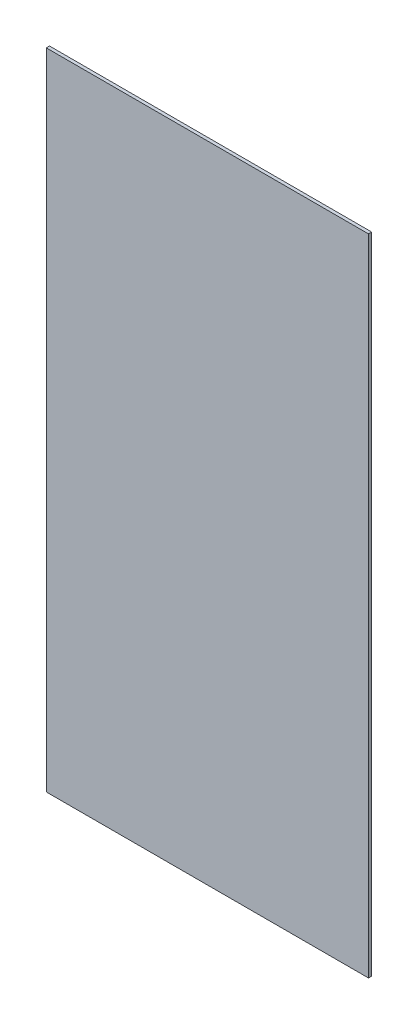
from build123d import *

# Parameters (mm, degrees)
ESQUISSE1_W        = 1000
ESQUISSE1_H        = 2000
BOSS_EXTRU_1_DEPTH = 10


with BuildPart() as part:
    # Esquisse1 → Boss.-Extru.1 (new body)
    with BuildSketch(Plane.XY):
        with Locations((-345, 366.571275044)):
            Rectangle(ESQUISSE1_W, ESQUISSE1_H)
    extrude(amount=BOSS_EXTRU_1_DEPTH)


solid = part.part
